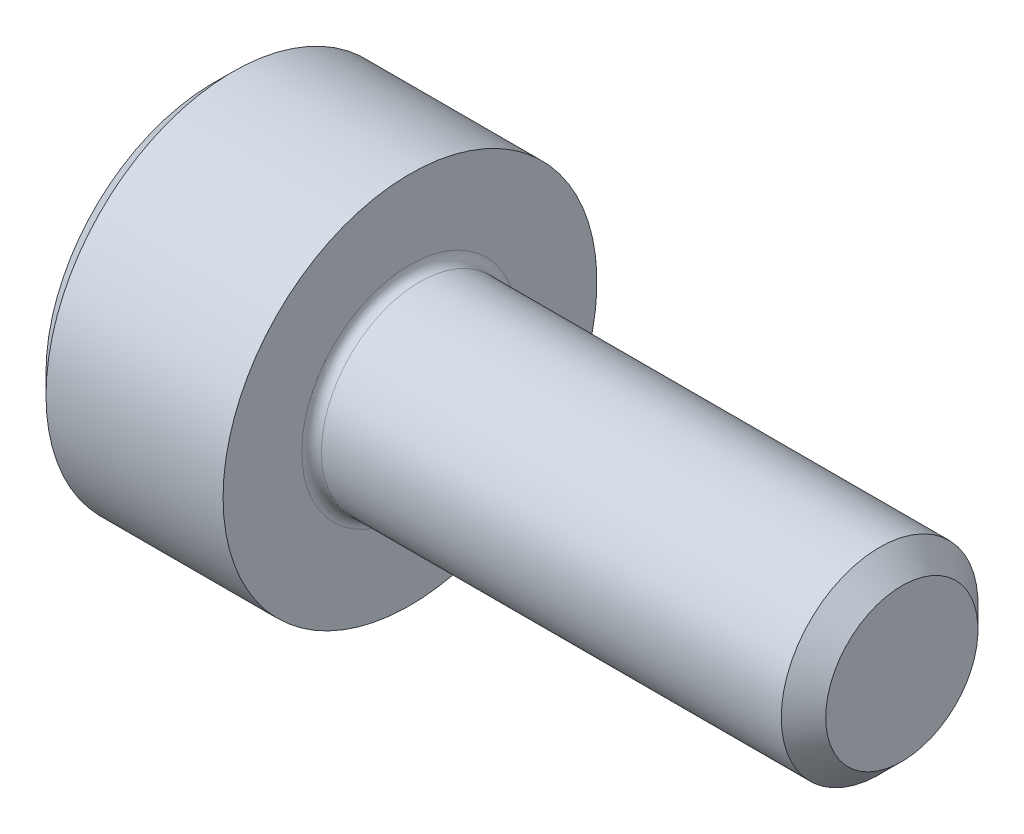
from build123d import *

# Parameters (mm, degrees)
FILLET1_R   = 0.1
HEX_2_DEPTH = 1


with BuildPart() as part:
    # BodySke → Base-Revolve (revolve)
    with BuildSketch(Plane.XY, mode=Mode.PRIVATE) as base_revolve_sk:
        Polygon((0, 0), (0, 1.7), (0.2, 1.9), (2, 1.9), (2, 1), (6.774, 1), (7, 0.774), (7, 0), align=None)
    revolve(base_revolve_sk.sketch.rotate(Axis((-31.75, 0, 0), (1, 0, 0)), 90), axis=Axis((-31.75, 0, 0), (1, 0, 0)))

    # Fillet1
    fillet1_edges = [part.edges().sort_by_distance(p)[0] for p in [
        (2, 0, -1),
    ]]
    fillet(fillet1_edges, radius=FILLET1_R)

    # Sketch2 → Hex-PreBroach (revolve, cut)
    with BuildSketch(Plane.XY, mode=Mode.PRIVATE) as hex_prebroach_sk:
        Polygon((0, 0.7725), (1, 0.7725), (1.446003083, 0), (0, 0), align=None)
    revolve(hex_prebroach_sk.sketch.rotate(Axis((0, 0, 0), (1, 0, 0)), 90), axis=Axis((0, 0, 0), (1, 0, 0)), mode=Mode.SUBTRACT)

    # Sketch3 → Hex 2 (cut)
    with BuildSketch(Plane(origin=(0, 0, 0), x_dir=(0, 0.500000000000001, 0.866025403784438), z_dir=(-1, 0, 0))):
        Polygon((0.446003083, 0.7725), (-0.446003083, 0.7725), (-0.892006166, 0), (-0.446003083, -0.7725), (0.446003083, -0.7725), (0.892006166, 0), align=None)
    extrude(amount=-HEX_2_DEPTH, mode=Mode.SUBTRACT)


solid = part.part
